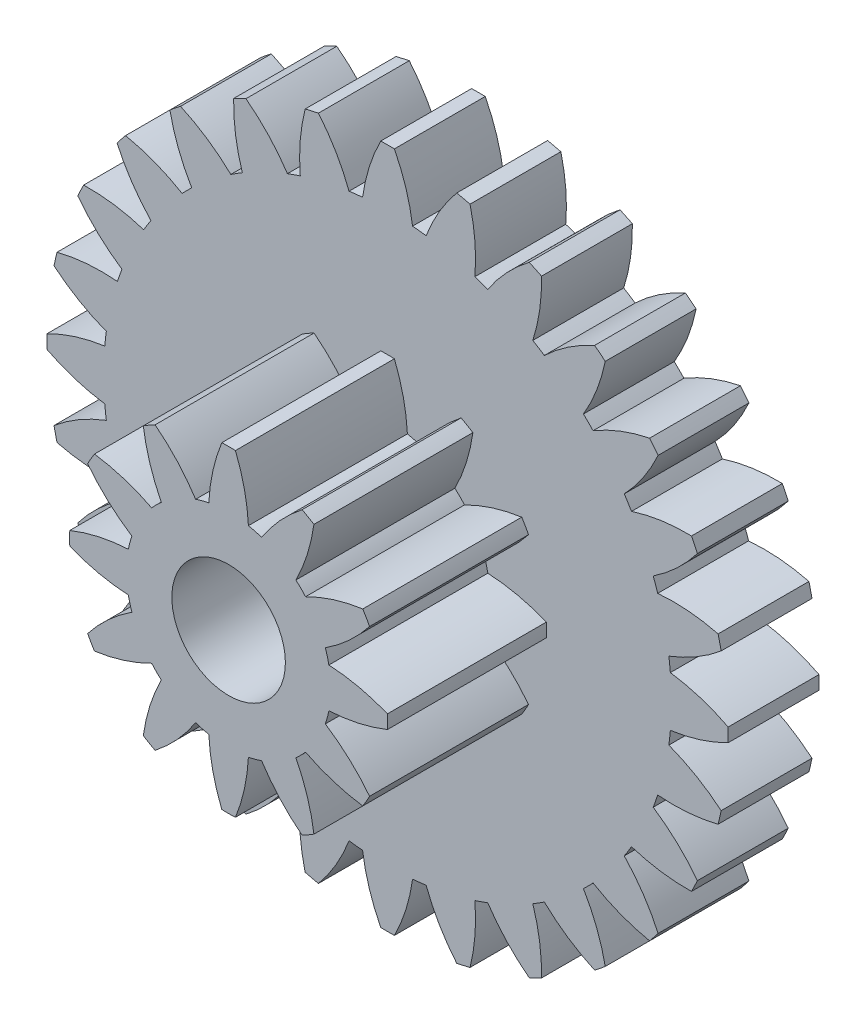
from build123d import *

# Parameters (mm, degrees)
ESQUISSE1_R                  = 7.5
BASE_EXTRUSION_DEPTH         = 2
ESQUISSE2_R                  = 3.5
BOSS_EXTRU_1_DEPTH           = 3.5
ENL_V_START                  = -3.5
ENL_V_MAT_EXTRU_1_DEPTH      = 3.5
R_P_TITION_CIRCULAIRE1_COUNT = 12
ENL_V_MAT_EXTRU_2_DEPTH      = 12.169153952
R_P_TITION_CIRCULAIRE2_COUNT = 28
ESQUISSE5_R                  = 1.25
ENL_V_MAT_EXTRU_3_DEPTH      = 12.947803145


with BuildPart() as part:
    # Esquisse1 → Base-Extrusion (new body)
    with BuildSketch(Plane.XY):
        Circle(ESQUISSE1_R)
    extrude(amount=BASE_EXTRUSION_DEPTH)

    # Esquisse2 → Boss.-Extru.1 (add)
    with BuildSketch(Plane.XY.offset(2)):
        Circle(ESQUISSE2_R)
    extrude(amount=BOSS_EXTRU_1_DEPTH)

    # Esquisse3 → Enl_v. mat.-Extru.1 (cut)
    with BuildSketch(Plane.XY.offset(5.5).offset(ENL_V_START)):
        with BuildLine():
            Line((0.582342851, 2.173333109), (1.08873197, 4.063203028))
            Line((1.08873197, 4.063203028), (-1.08873197, 4.063203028))
            Line((-1.08873197, 4.063203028), (-0.582342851, 2.173333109))
            ThreePointArc((-0.582342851, 2.173333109), (-0.509534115, 2.191546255), (-0.436158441, 2.207320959))
            ThreePointArc((-0.436158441, 2.207320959), (-0.346670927, 2.8639457), (-0.15, 3.496784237))
            ThreePointArc((-0.15, 3.496784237), (0, 3.5), (0.15, 3.496784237))
            ThreePointArc((0.15, 3.496784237), (0.346670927, 2.8639457), (0.436158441, 2.207320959))
            ThreePointArc((0.436158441, 2.207320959), (0.509534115, 2.191546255), (0.582342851, 2.173333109))
        make_face()
    enl_v_mat_extru_1 = extrude(amount=ENL_V_MAT_EXTRU_1_DEPTH, mode=Mode.SUBTRACT)

    # R_p_tition circulaire1: Enl_v. mat.-Extru.1 ×12 about axis
    r_p_tition_circulaire1_axis = Axis((0, 0, 0), (0, 0, -1))
    for i in range(1, R_P_TITION_CIRCULAIRE1_COUNT):
        add(enl_v_mat_extru_1.rotate(r_p_tition_circulaire1_axis, i * 360 / R_P_TITION_CIRCULAIRE1_COUNT), mode=Mode.SUBTRACT)

    # Esquisse4 → Enl_v. mat.-Extru.2 (cut, through all)
    with BuildSketch(Plane.XY.offset(2)):
        with BuildLine():
            Line((0.699777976, 6.210701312), (0.966987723, 8.582253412))
            Line((0.966987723, 8.582253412), (-0.966987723, 8.582253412))
            Line((-0.966987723, 8.582253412), (-0.699777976, 6.210701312))
            ThreePointArc((-0.699777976, 6.210701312), (-0.625193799, 6.218652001), (-0.550519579, 6.225707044))
            ThreePointArc((-0.550519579, 6.225707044), (-0.403706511, 6.878921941), (-0.15, 7.49849985))
            ThreePointArc((-0.15, 7.49849985), (0, 7.5), (0.15, 7.49849985))
            ThreePointArc((0.15, 7.49849985), (0.403706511, 6.878921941), (0.550519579, 6.225707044))
            ThreePointArc((0.550519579, 6.225707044), (0.625193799, 6.218652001), (0.699777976, 6.210701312))
        make_face()
    enl_v_mat_extru_2 = extrude(amount=-ENL_V_MAT_EXTRU_2_DEPTH, mode=Mode.SUBTRACT)

    # R_p_tition circulaire2: Enl_v. mat.-Extru.2 ×28 about axis
    r_p_tition_circulaire2_axis = Axis((0, 0, 0), (0, 0, -1))
    for i in range(1, R_P_TITION_CIRCULAIRE2_COUNT):
        add(enl_v_mat_extru_2.rotate(r_p_tition_circulaire2_axis, i * 360 / R_P_TITION_CIRCULAIRE2_COUNT), mode=Mode.SUBTRACT)

    # Esquisse5 → Enl_v. mat.-Extru.3 (cut, through all)
    with BuildSketch(Plane.XY.offset(5.5)):
        Circle(ESQUISSE5_R)
    extrude(amount=-ENL_V_MAT_EXTRU_3_DEPTH, mode=Mode.SUBTRACT)


solid = part.part
